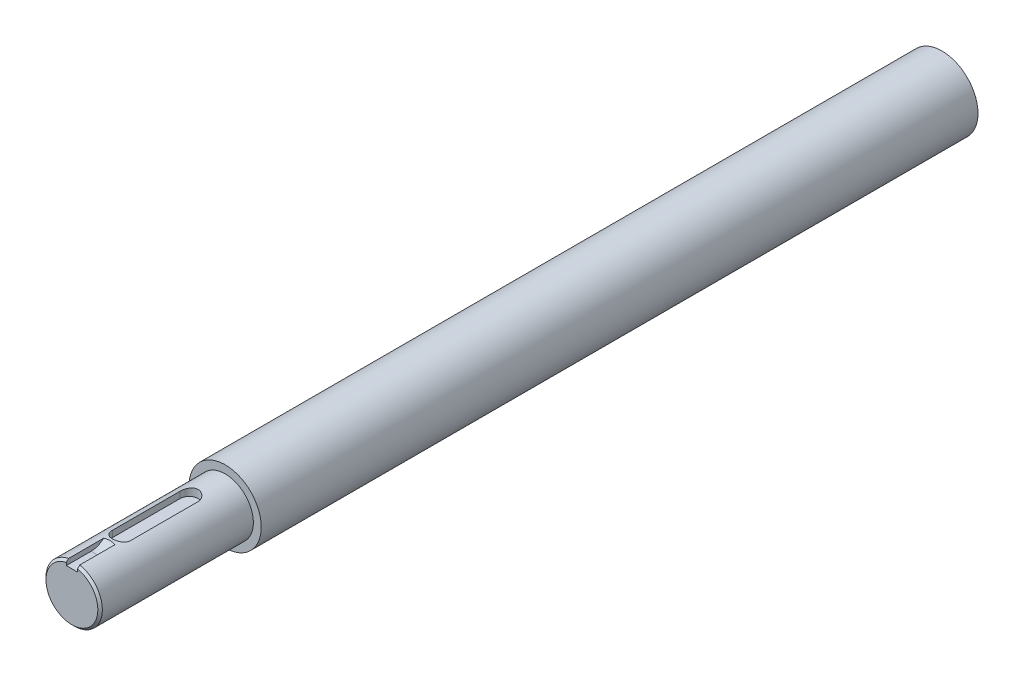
ISO-10303-21;
HEADER;
FILE_DESCRIPTION(('STEP AP214'),'2;1');
FILE_NAME('part.step','',(''),(''),'','','');
FILE_SCHEMA(('AUTOMOTIVE_DESIGN { 1 0 10303 214 1 1 1 1 }'));
ENDSEC;
DATA;
#1=APPLICATION_CONTEXT('core data for automotive mechanical design processes');
#2=APPLICATION_PROTOCOL_DEFINITION('international standard','automotive_design',2000,#1);
#3=PRODUCT_CONTEXT('',#1,'mechanical');
#4=PRODUCT('Part','Part','',(#3));
#5=PRODUCT_RELATED_PRODUCT_CATEGORY('part','',(#4));
#6=PRODUCT_DEFINITION_FORMATION('','',#4);
#7=PRODUCT_DEFINITION_CONTEXT('part definition',#1,'design');
#8=PRODUCT_DEFINITION('design','',#6,#7);
#9=PRODUCT_DEFINITION_SHAPE('','',#8);
#10=(LENGTH_UNIT() NAMED_UNIT(*) SI_UNIT(.MILLI.,.METRE.));
#11=(NAMED_UNIT(*) PLANE_ANGLE_UNIT() SI_UNIT($,.RADIAN.));
#12=(NAMED_UNIT(*) SI_UNIT($,.STERADIAN.) SOLID_ANGLE_UNIT());
#13=UNCERTAINTY_MEASURE_WITH_UNIT(LENGTH_MEASURE(1.E-05),#10,'distance_accuracy_value','');
#14=(GEOMETRIC_REPRESENTATION_CONTEXT(3) GLOBAL_UNCERTAINTY_ASSIGNED_CONTEXT((#13)) GLOBAL_UNIT_ASSIGNED_CONTEXT((#10,
#11,#12)) REPRESENTATION_CONTEXT('',''));
#15=CARTESIAN_POINT('',(0.,0.,0.));
#16=DIRECTION('',(0.,0.,1.));
#17=DIRECTION('',(1.,0.,0.));
#18=AXIS2_PLACEMENT_3D('',#15,#16,#17);
#19=CARTESIAN_POINT('',(0.,0.,68.));
#20=DIRECTION('',(0.,0.,-1.));
#21=DIRECTION('',(-1.,0.,0.));
#22=AXIS2_PLACEMENT_3D('',#19,#20,#21);
#23=CYLINDRICAL_SURFACE('',#22,12.5);
#24=DIRECTION('',(0.,0.,-1.));
#25=VECTOR('',#24,1.);
#26=CARTESIAN_POINT('',(4.,11.842719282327,68.));
#27=LINE('',#26,#25);
#28=CARTESIAN_POINT('',(4.,11.842719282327,16.));
#29=VERTEX_POINT('',#28);
#30=CARTESIAN_POINT('',(4.,11.842719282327,46.));
#31=VERTEX_POINT('',#30);
#32=EDGE_CURVE('E149',#29,#31,#27,.F.);
#33=ORIENTED_EDGE('',*,*,#32,.T.);
#34=CARTESIAN_POINT('',(4.,11.842719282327,46.));
#35=CARTESIAN_POINT('',(4.00001410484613,11.8427027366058,46.1093997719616));
#36=CARTESIAN_POINT('',(3.995512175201,11.8442348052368,46.2187902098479));
#37=CARTESIAN_POINT('',(3.97758606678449,11.8502730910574,46.4367282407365));
#38=CARTESIAN_POINT('',(3.96416412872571,11.8547785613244,46.5452760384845));
#39=CARTESIAN_POINT('',(3.92855725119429,11.8666242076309,46.7604610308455));
#40=CARTESIAN_POINT('',(3.9063967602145,11.8739564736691,46.8671026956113));
#41=CARTESIAN_POINT('',(3.85353581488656,11.8912164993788,47.0780056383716));
#42=CARTESIAN_POINT('',(3.82283508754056,11.90114434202,47.1822668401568));
#43=CARTESIAN_POINT('',(3.71831764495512,11.9343840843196,47.4903050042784));
#44=CARTESIAN_POINT('',(3.63203544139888,11.9611699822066,47.689636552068));
#45=CARTESIAN_POINT('',(3.42895021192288,12.0209583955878,48.0710125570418));
#46=CARTESIAN_POINT('',(3.3121303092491,12.0539643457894,48.2530473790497));
#47=CARTESIAN_POINT('',(3.04678507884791,12.123798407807,48.6012539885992));
#48=CARTESIAN_POINT('',(2.89735303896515,12.1607158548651,48.7667183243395));
#49=CARTESIAN_POINT('',(2.57296449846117,12.2334561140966,49.0707148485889));
#50=CARTESIAN_POINT('',(2.39800356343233,12.2692787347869,49.2092423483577));
#51=CARTESIAN_POINT('',(2.02237003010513,12.3368244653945,49.4586151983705));
#52=CARTESIAN_POINT('',(1.82118394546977,12.3684294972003,49.5687219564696));
#53=CARTESIAN_POINT('',(1.40197197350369,12.4229251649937,49.7532494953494));
#54=CARTESIAN_POINT('',(1.18395091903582,12.4458182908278,49.8276804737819));
#55=CARTESIAN_POINT('',(0.744713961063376,12.4796767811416,49.9363588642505));
#56=CARTESIAN_POINT('',(0.523827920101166,12.4910030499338,49.9718249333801));
#57=CARTESIAN_POINT('',(0.0789648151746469,12.5017287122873,50.0054327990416));
#58=CARTESIAN_POINT('',(-0.145011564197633,12.5011307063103,50.0035827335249));
#59=CARTESIAN_POINT('',(-0.581094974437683,12.4883236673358,49.9634011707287));
#60=CARTESIAN_POINT('',(-0.793338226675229,12.4765355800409,49.9263922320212));
#61=CARTESIAN_POINT('',(-1.2084232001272,12.443194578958,49.8191194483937));
#62=CARTESIAN_POINT('',(-1.41126440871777,12.4216411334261,49.7488537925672));
#63=CARTESIAN_POINT('',(-1.80478548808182,12.3706364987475,49.5762421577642));
#64=CARTESIAN_POINT('',(-1.99528012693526,12.3410893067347,49.4735034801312));
#65=CARTESIAN_POINT('',(-2.35673113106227,12.2771965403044,49.2391709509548));
#66=CARTESIAN_POINT('',(-2.52768253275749,12.2428497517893,49.107569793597));
#67=CARTESIAN_POINT('',(-2.8530451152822,12.1712409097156,48.8125534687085));
#68=CARTESIAN_POINT('',(-3.00641313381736,12.1339170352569,48.6480032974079));
#69=CARTESIAN_POINT('',(-3.28377291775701,12.0618172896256,48.2950280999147));
#70=CARTESIAN_POINT('',(-3.40775562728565,12.0270422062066,48.1065957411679));
#71=CARTESIAN_POINT('',(-3.56958208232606,11.9796198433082,47.8086287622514));
#72=CARTESIAN_POINT('',(-3.61975674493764,11.9645161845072,47.7060009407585));
#73=CARTESIAN_POINT('',(-3.71123075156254,11.9364591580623,47.4965952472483));
#74=CARTESIAN_POINT('',(-3.75253376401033,11.9235049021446,47.3898191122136));
#75=CARTESIAN_POINT('',(-3.82585831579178,11.9001802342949,47.1729866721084));
#76=CARTESIAN_POINT('',(-3.85788979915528,11.889807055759,47.0629340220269));
#77=CARTESIAN_POINT('',(-3.91241790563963,11.8719756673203,46.8403048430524));
#78=CARTESIAN_POINT('',(-3.93491889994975,11.8645161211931,46.7277294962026));
#79=CARTESIAN_POINT('',(-3.96832908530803,11.8533815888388,46.512760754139));
#80=CARTESIAN_POINT('',(-3.98020384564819,11.8493925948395,46.4105325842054));
#81=CARTESIAN_POINT('',(-3.9960393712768,11.8440568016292,46.2055389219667));
#82=CARTESIAN_POINT('',(-4.00001099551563,11.8427063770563,46.1027743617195));
#83=CARTESIAN_POINT('',(-4.,11.842719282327,46.));
#84=B_SPLINE_CURVE_WITH_KNOTS('',3,(#34,#35,#36,#37,#38,#39,#40,#41,#42,#43,#44,#45,#46,#47,#48,
#49,#50,#51,#52,#53,#54,#55,#56,#57,#58,#59,#60,#61,#62,#63,#64,#65,#66,#67,#68,#69,#70,#71,#72,
#73,#74,#75,#76,#77,#78,#79,#80,#81,#82,#83),.UNSPECIFIED.,.F.,.F.,(4,2,2,2,2,2,2,2,2,2,2,2,2,2,
2,2,2,2,2,2,2,2,2,2,4),(0.,0.328080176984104,0.656077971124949,0.983164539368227,
1.31026156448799,1.96355293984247,2.61720612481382,3.29209427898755,3.96709980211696,
4.65819584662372,5.34909422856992,6.01770820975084,6.68617638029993,7.33045501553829,
7.97476873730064,8.62719320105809,9.27978300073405,9.96076419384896,10.6419549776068,
10.9872862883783,11.3324745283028,11.6772911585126,12.0219494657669,12.3305938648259,
12.6388138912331),.UNSPECIFIED.);
#85=CARTESIAN_POINT('',(-4.,11.842719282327,46.));
#86=VERTEX_POINT('',#85);
#87=EDGE_CURVE('E153',#31,#86,#84,.T.);
#88=ORIENTED_EDGE('',*,*,#87,.T.);
#89=DIRECTION('',(0.,0.,-1.));
#90=VECTOR('',#89,1.);
#91=CARTESIAN_POINT('',(-4.,11.842719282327,68.));
#92=LINE('',#91,#90);
#93=CARTESIAN_POINT('',(-4.,11.842719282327,16.));
#94=VERTEX_POINT('',#93);
#95=EDGE_CURVE('E158',#86,#94,#92,.T.);
#96=ORIENTED_EDGE('',*,*,#95,.T.);
#97=CARTESIAN_POINT('',(-3.99999999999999,11.842719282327,16.));
#98=CARTESIAN_POINT('',(-4.00001410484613,11.8427027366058,15.8906002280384));
#99=CARTESIAN_POINT('',(-3.99551217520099,11.8442348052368,15.7812097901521));
#100=CARTESIAN_POINT('',(-3.97758606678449,11.8502730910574,15.5632717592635));
#101=CARTESIAN_POINT('',(-3.9641641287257,11.8547785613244,15.4547239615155));
#102=CARTESIAN_POINT('',(-3.92855725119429,11.8666242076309,15.2395389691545));
#103=CARTESIAN_POINT('',(-3.90639676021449,11.8739564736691,15.1328973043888));
#104=CARTESIAN_POINT('',(-3.85353581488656,11.8912164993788,14.9219943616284));
#105=CARTESIAN_POINT('',(-3.82283508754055,11.90114434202,14.8177331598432));
#106=CARTESIAN_POINT('',(-3.71831764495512,11.9343840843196,14.5096949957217));
#107=CARTESIAN_POINT('',(-3.63203544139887,11.9611699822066,14.310363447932));
#108=CARTESIAN_POINT('',(-3.42895021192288,12.0209583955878,13.9289874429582));
#109=CARTESIAN_POINT('',(-3.31213030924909,12.0539643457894,13.7469526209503));
#110=CARTESIAN_POINT('',(-3.0467850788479,12.123798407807,13.3987460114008));
#111=CARTESIAN_POINT('',(-2.89735303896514,12.1607158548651,13.2332816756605));
#112=CARTESIAN_POINT('',(-2.57296449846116,12.2334561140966,12.9292851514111));
#113=CARTESIAN_POINT('',(-2.39800356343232,12.2692787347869,12.7907576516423));
#114=CARTESIAN_POINT('',(-2.02237003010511,12.3368244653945,12.5413848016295));
#115=CARTESIAN_POINT('',(-1.82118394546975,12.3684294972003,12.4312780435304));
#116=CARTESIAN_POINT('',(-1.40197197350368,12.4229251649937,12.2467505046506));
#117=CARTESIAN_POINT('',(-1.1839509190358,12.4458182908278,12.1723195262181));
#118=CARTESIAN_POINT('',(-0.744713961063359,12.4796767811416,12.0636411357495));
#119=CARTESIAN_POINT('',(-0.52382792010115,12.4910030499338,12.0281750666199));
#120=CARTESIAN_POINT('',(-0.0789648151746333,12.5017287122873,11.9945672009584));
#121=CARTESIAN_POINT('',(0.145011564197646,12.5011307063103,11.9964172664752));
#122=CARTESIAN_POINT('',(0.581094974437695,12.4883236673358,12.0365988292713));
#123=CARTESIAN_POINT('',(0.793338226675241,12.4765355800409,12.0736077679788));
#124=CARTESIAN_POINT('',(1.20842320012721,12.443194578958,12.1808805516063));
#125=CARTESIAN_POINT('',(1.41126440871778,12.4216411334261,12.2511462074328));
#126=CARTESIAN_POINT('',(1.80478548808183,12.3706364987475,12.4237578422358));
#127=CARTESIAN_POINT('',(1.99528012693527,12.3410893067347,12.5264965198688));
#128=CARTESIAN_POINT('',(2.35673113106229,12.2771965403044,12.7608290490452));
#129=CARTESIAN_POINT('',(2.5276825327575,12.2428497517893,12.892430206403));
#130=CARTESIAN_POINT('',(2.85304511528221,12.1712409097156,13.1874465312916));
#131=CARTESIAN_POINT('',(3.00641313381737,12.1339170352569,13.3519967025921));
#132=CARTESIAN_POINT('',(3.28377291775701,12.0618172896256,13.7049719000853));
#133=CARTESIAN_POINT('',(3.40775562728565,12.0270422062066,13.8934042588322));
#134=CARTESIAN_POINT('',(3.56958208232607,11.9796198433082,14.1913712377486));
#135=CARTESIAN_POINT('',(3.61975674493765,11.9645161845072,14.2939990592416));
#136=CARTESIAN_POINT('',(3.71123075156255,11.9364591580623,14.5034047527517));
#137=CARTESIAN_POINT('',(3.75253376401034,11.9235049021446,14.6101808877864));
#138=CARTESIAN_POINT('',(3.82585831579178,11.9001802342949,14.8270133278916));
#139=CARTESIAN_POINT('',(3.85788979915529,11.889807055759,14.9370659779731));
#140=CARTESIAN_POINT('',(3.91241790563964,11.8719756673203,15.1596951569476));
#141=CARTESIAN_POINT('',(3.93491889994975,11.8645161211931,15.2722705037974));
#142=CARTESIAN_POINT('',(3.96832908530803,11.8533815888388,15.487239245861));
#143=CARTESIAN_POINT('',(3.9802038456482,11.8493925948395,15.5894674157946));
#144=CARTESIAN_POINT('',(3.9960393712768,11.8440568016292,15.7944610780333));
#145=CARTESIAN_POINT('',(4.00001099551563,11.8427063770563,15.8972256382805));
#146=CARTESIAN_POINT('',(4.,11.842719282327,16.));
#147=B_SPLINE_CURVE_WITH_KNOTS('',3,(#97,#98,#99,#100,#101,#102,#103,#104,#105,#106,#107,#108,
#109,#110,#111,#112,#113,#114,#115,#116,#117,#118,#119,#120,#121,#122,#123,#124,#125,#126,#127,
#128,#129,#130,#131,#132,#133,#134,#135,#136,#137,#138,#139,#140,#141,#142,#143,#144,#145,#146),
.UNSPECIFIED.,.F.,.F.,(4,2,2,2,2,2,2,2,2,2,2,2,2,2,2,2,2,2,2,2,2,2,2,2,4),(0.,0.328080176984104,
0.656077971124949,0.983164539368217,1.310261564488,1.96355293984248,2.61720612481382,
3.29209427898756,3.96709980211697,4.65819584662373,5.34909422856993,6.01770820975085,
6.68617638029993,7.3304550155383,7.97476873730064,8.6271932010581,9.27978300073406,
9.96076419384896,10.6419549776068,10.9872862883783,11.3324745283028,11.6772911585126,
12.0219494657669,12.3305938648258,12.6388138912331),.UNSPECIFIED.);
#148=EDGE_CURVE('E163',#94,#29,#147,.T.);
#149=ORIENTED_EDGE('',*,*,#148,.T.);
#150=EDGE_LOOP('',(#33,#88,#96,#149));
#151=FACE_BOUND('',#150,.T.);
#152=CARTESIAN_POINT('',(0.,0.,0.));
#153=DIRECTION('',(0.,0.,-1.));
#154=DIRECTION('',(-1.,0.,0.));
#155=AXIS2_PLACEMENT_3D('',#152,#153,#154);
#156=CIRCLE('',#155,12.5);
#157=CARTESIAN_POINT('',(-12.5,0.,0.));
#158=VERTEX_POINT('',#157);
#159=EDGE_CURVE('E146',#158,#158,#156,.T.);
#160=ORIENTED_EDGE('',*,*,#159,.F.);
#161=EDGE_LOOP('',(#160));
#162=FACE_BOUND('',#161,.T.);
#163=DIRECTION('',(0.,0.,-1.));
#164=VECTOR('',#163,1.);
#165=CARTESIAN_POINT('',(-2.5,12.2474487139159,68.));
#166=LINE('',#165,#164);
#167=CARTESIAN_POINT('',(-2.5,12.2474487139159,51.4404897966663));
#168=VERTEX_POINT('',#167);
#169=CARTESIAN_POINT('',(-2.5,12.2474487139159,67.));
#170=VERTEX_POINT('',#169);
#171=EDGE_CURVE('E137',#168,#170,#166,.F.);
#172=ORIENTED_EDGE('',*,*,#171,.F.);
#173=CARTESIAN_POINT('',(0.,12.5,62.8094750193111));
#174=CARTESIAN_POINT('',(-0.239595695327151,12.4999992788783,62.8094756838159));
#175=CARTESIAN_POINT('',(-0.479203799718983,12.4931020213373,62.8029680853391));
#176=CARTESIAN_POINT('',(-0.956929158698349,12.4656143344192,62.7767579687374));
#177=CARTESIAN_POINT('',(-1.19504627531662,12.4450226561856,62.7570542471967));
#178=CARTESIAN_POINT('',(-1.66843511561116,12.390445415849,62.7038892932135));
#179=CARTESIAN_POINT('',(-1.90370393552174,12.3564472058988,62.6704150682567));
#180=CARTESIAN_POINT('',(-2.36946620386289,12.2756460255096,62.5888342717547));
#181=CARTESIAN_POINT('',(-2.59995984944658,12.2288435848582,62.5407283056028));
#182=CARTESIAN_POINT('',(-3.05606355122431,12.1229407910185,62.4282768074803));
#183=CARTESIAN_POINT('',(-3.28162253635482,12.0637487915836,62.3638094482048));
#184=CARTESIAN_POINT('',(-3.72389744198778,11.9346405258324,62.2173691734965));
#185=CARTESIAN_POINT('',(-3.94061213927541,11.8647227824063,62.1353938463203));
#186=CARTESIAN_POINT('',(-4.36221995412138,11.7162648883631,61.9526254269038));
#187=CARTESIAN_POINT('',(-4.56714059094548,11.6377461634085,61.8518786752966));
#188=CARTESIAN_POINT('',(-4.96297691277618,11.4745202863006,61.63001586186));
#189=CARTESIAN_POINT('',(-5.15390065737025,11.3898167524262,61.5089116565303));
#190=CARTESIAN_POINT('',(-5.45748315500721,11.2465052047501,61.2896635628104));
#191=CARTESIAN_POINT('',(-5.57486990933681,11.188700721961,61.1974941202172));
#192=CARTESIAN_POINT('',(-5.80140819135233,11.0729321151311,61.0035587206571));
#193=CARTESIAN_POINT('',(-5.91055902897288,11.014967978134,60.9017919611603));
#194=CARTESIAN_POINT('',(-6.11970339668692,10.9001588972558,60.6887514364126));
#195=CARTESIAN_POINT('',(-6.21970088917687,10.8433134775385,60.5774818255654));
#196=CARTESIAN_POINT('',(-6.40977973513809,10.7320479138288,60.3456533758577));
#197=CARTESIAN_POINT('',(-6.49986233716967,10.6776274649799,60.2250957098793));
#198=CARTESIAN_POINT('',(-6.66996940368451,10.5722085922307,59.974312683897));
#199=CARTESIAN_POINT('',(-6.74992154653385,10.5212358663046,59.8440273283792));
#200=CARTESIAN_POINT('',(-6.89836991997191,10.4245069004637,59.5753212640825));
#201=CARTESIAN_POINT('',(-6.96687134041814,10.3787483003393,59.436904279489));
#202=CARTESIAN_POINT('',(-7.0919399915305,10.293692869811,59.1528604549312));
#203=CARTESIAN_POINT('',(-7.1485066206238,10.2543963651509,59.0072332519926));
#204=CARTESIAN_POINT('',(-7.24929354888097,10.1833958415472,58.7099819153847));
#205=CARTESIAN_POINT('',(-7.29351523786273,10.1516909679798,58.5583584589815));
#206=CARTESIAN_POINT('',(-7.36519404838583,10.0997847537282,58.2672868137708));
#207=CARTESIAN_POINT('',(-7.39395337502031,10.0787060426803,58.1283137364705));
#208=CARTESIAN_POINT('',(-7.44131474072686,10.0437893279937,57.8477547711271));
#209=CARTESIAN_POINT('',(-7.45991755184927,10.0299507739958,57.7061690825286));
#210=CARTESIAN_POINT('',(-7.48688103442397,10.0098399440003,57.4215364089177));
#211=CARTESIAN_POINT('',(-7.49524476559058,10.003565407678,57.2784898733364));
#212=CARTESIAN_POINT('',(-7.50170521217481,9.99872174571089,56.9920349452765));
#213=CARTESIAN_POINT('',(-7.49980214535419,10.0001524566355,56.8486265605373));
#214=CARTESIAN_POINT('',(-7.48611551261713,10.0104015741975,56.5702745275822));
#215=CARTESIAN_POINT('',(-7.47486721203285,10.0188197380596,56.4352893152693));
#216=CARTESIAN_POINT('',(-7.44322169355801,10.0423522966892,56.1669399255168));
#217=CARTESIAN_POINT('',(-7.42282150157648,10.0574688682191,56.033576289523));
#218=CARTESIAN_POINT('',(-7.37296632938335,10.0940735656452,55.7695184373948));
#219=CARTESIAN_POINT('',(-7.34351615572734,10.1155583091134,55.6388228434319));
#220=CARTESIAN_POINT('',(-7.27567395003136,10.1644634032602,55.3808612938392));
#221=CARTESIAN_POINT('',(-7.23727860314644,10.1918859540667,55.253596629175));
#222=CARTESIAN_POINT('',(-7.15148271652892,10.2522708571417,55.0026428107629));
#223=CARTESIAN_POINT('',(-7.10403240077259,10.2852637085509,54.8789779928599));
#224=CARTESIAN_POINT('',(-7.00051695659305,10.3559980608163,54.6366982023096));
#225=CARTESIAN_POINT('',(-6.94444873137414,10.3937412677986,54.5180850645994));
#226=CARTESIAN_POINT('',(-6.76376657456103,10.512956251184,54.1708893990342));
#227=CARTESIAN_POINT('',(-6.62660135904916,10.6004671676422,53.9507350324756));
#228=CARTESIAN_POINT('',(-6.31287192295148,10.7904219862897,53.5243823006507));
#229=CARTESIAN_POINT('',(-6.13441203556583,10.8934516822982,53.3198593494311));
#230=CARTESIAN_POINT('',(-5.74814222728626,11.1021138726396,52.9421941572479));
#231=CARTESIAN_POINT('',(-5.54031956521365,11.2077474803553,52.7690656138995));
#232=CARTESIAN_POINT('',(-5.19589885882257,11.3697734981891,52.5221059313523));
#233=CARTESIAN_POINT('',(-5.06738337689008,11.4276983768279,52.4377193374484));
#234=CARTESIAN_POINT('',(-4.80348056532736,11.5411075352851,52.2785324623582));
#235=CARTESIAN_POINT('',(-4.66809270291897,11.5965916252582,52.2037329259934));
#236=CARTESIAN_POINT('',(-4.3913006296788,11.7042107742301,52.0633137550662));
#237=CARTESIAN_POINT('',(-4.24989391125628,11.7563444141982,51.997697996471));
#238=CARTESIAN_POINT('',(-3.96192346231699,11.8564922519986,51.8752005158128));
#239=CARTESIAN_POINT('',(-3.81535906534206,11.9045059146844,51.8183199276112));
#240=CARTESIAN_POINT('',(-3.4882809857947,12.0048602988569,51.7023303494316));
#241=CARTESIAN_POINT('',(-3.30680828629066,12.0561650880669,51.6450243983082));
#242=CARTESIAN_POINT('',(-2.93877834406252,12.1511199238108,51.5414713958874));
#243=CARTESIAN_POINT('',(-2.75222055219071,12.1947691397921,51.4952255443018));
#244=CARTESIAN_POINT('',(-2.37503220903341,12.2738082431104,51.4130526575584));
#245=CARTESIAN_POINT('',(-2.18439968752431,12.3091940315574,51.3771307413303));
#246=CARTESIAN_POINT('',(-1.80014820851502,12.3712309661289,51.3150303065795));
#247=CARTESIAN_POINT('',(-1.6065290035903,12.3978813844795,51.2888525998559));
#248=CARTESIAN_POINT('',(-1.18017934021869,12.4463461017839,51.2416757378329));
#249=CARTESIAN_POINT('',(-0.947016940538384,12.4662753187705,51.2226097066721));
#250=CARTESIAN_POINT('',(-0.479240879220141,12.4930072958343,51.1971243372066));
#251=CARTESIAN_POINT('',(-0.244627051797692,12.4998085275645,51.1907064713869));
#252=CARTESIAN_POINT('',(0.224876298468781,12.5001836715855,51.190350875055));
#253=CARTESIAN_POINT('',(0.459765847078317,12.493743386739,51.196426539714));
#254=CARTESIAN_POINT('',(0.928143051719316,12.4677010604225,51.2212467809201));
#255=CARTESIAN_POINT('',(1.16163069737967,12.4480989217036,51.2399914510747));
#256=CARTESIAN_POINT('',(1.64493715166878,12.3938725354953,51.2927329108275));
#257=CARTESIAN_POINT('',(1.89451061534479,12.3581405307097,51.3278623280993));
#258=CARTESIAN_POINT('',(2.38832937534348,12.2722732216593,51.4145842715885));
#259=CARTESIAN_POINT('',(2.63257375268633,12.222135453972,51.4661796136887));
#260=CARTESIAN_POINT('',(3.11308596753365,12.1086556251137,51.58715134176));
#261=CARTESIAN_POINT('',(3.3493654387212,12.0453338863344,51.6565003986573));
#262=CARTESIAN_POINT('',(3.8117546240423,11.9070847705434,51.8146922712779));
#263=CARTESIAN_POINT('',(4.03786886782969,11.8321626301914,51.9035262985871));
#264=CARTESIAN_POINT('',(4.4118312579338,11.6966989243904,52.0728933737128));
#265=CARTESIAN_POINT('',(4.56297849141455,11.6384954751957,52.148055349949));
#266=CARTESIAN_POINT('',(4.85776364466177,11.5185686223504,52.3094608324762));
#267=CARTESIAN_POINT('',(5.00140326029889,11.4568460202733,52.3957018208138));
#268=CARTESIAN_POINT('',(5.27997909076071,11.3311590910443,52.5797100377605));
#269=CARTESIAN_POINT('',(5.41491917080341,11.2671957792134,52.6774720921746));
#270=CARTESIAN_POINT('',(5.67498346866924,11.1384744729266,52.8848624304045));
#271=CARTESIAN_POINT('',(5.8001074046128,11.0737164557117,52.9944910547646));
#272=CARTESIAN_POINT('',(6.04047525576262,10.9444715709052,53.2267599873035));
#273=CARTESIAN_POINT('',(6.15561486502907,10.8799930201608,53.3495132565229));
#274=CARTESIAN_POINT('',(6.37349059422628,10.7538119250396,53.6068768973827));
#275=CARTESIAN_POINT('',(6.47622871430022,10.6921089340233,53.741485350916));
#276=CARTESIAN_POINT('',(6.66821567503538,10.573440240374,54.021852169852));
#277=CARTESIAN_POINT('',(6.75747141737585,10.5164721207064,54.1676047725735));
#278=CARTESIAN_POINT('',(6.9216462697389,10.4091518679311,54.4692629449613));
#279=CARTESIAN_POINT('',(6.9965682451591,10.3587984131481,54.6251664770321));
#280=CARTESIAN_POINT('',(7.12117910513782,10.2734424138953,54.9214518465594));
#281=CARTESIAN_POINT('',(7.17297034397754,10.2372699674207,55.0606171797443));
#282=CARTESIAN_POINT('',(7.26539878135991,10.1718823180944,55.3441821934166));
#283=CARTESIAN_POINT('',(7.30603747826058,10.1426661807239,55.4885811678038));
#284=CARTESIAN_POINT('',(7.37591560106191,10.0919638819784,55.7813802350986));
#285=CARTESIAN_POINT('',(7.40515929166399,10.0704748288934,55.9297788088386));
#286=CARTESIAN_POINT('',(7.45211354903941,10.0357790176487,56.2293428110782));
#287=CARTESIAN_POINT('',(7.46982480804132,10.0225717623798,56.3805080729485));
#288=CARTESIAN_POINT('',(7.49247646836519,10.0056469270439,56.6695358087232));
#289=CARTESIAN_POINT('',(7.49848714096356,10.0011344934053,56.8072695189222));
#290=CARTESIAN_POINT('',(7.50100995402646,9.99924267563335,57.082870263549));
#291=CARTESIAN_POINT('',(7.49752257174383,10.0018629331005,57.22073729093));
#292=CARTESIAN_POINT('',(7.48106536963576,10.0141782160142,57.4955443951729));
#293=CARTESIAN_POINT('',(7.46809828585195,10.0238712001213,57.6324847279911));
#294=CARTESIAN_POINT('',(7.43273610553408,10.0501202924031,57.9044775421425));
#295=CARTESIAN_POINT('',(7.41034093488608,10.0666764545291,58.0395300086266));
#296=CARTESIAN_POINT('',(7.35672376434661,10.1059237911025,58.3042752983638));
#297=CARTESIAN_POINT('',(7.32567470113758,10.1284944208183,58.4340211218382));
#298=CARTESIAN_POINT('',(7.2547128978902,10.1794423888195,58.6899431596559));
#299=CARTESIAN_POINT('',(7.21479722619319,10.2078216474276,58.8161181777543));
#300=CARTESIAN_POINT('',(7.12631286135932,10.2697895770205,59.0640167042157));
#301=CARTESIAN_POINT('',(7.07774746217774,10.3033762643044,59.1857418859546));
#302=CARTESIAN_POINT('',(6.97218257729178,10.3751020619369,59.4241359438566));
#303=CARTESIAN_POINT('',(6.91517994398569,10.4132428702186,59.5408029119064));
#304=CARTESIAN_POINT('',(6.79098360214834,10.4946763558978,59.7723048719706));
#305=CARTESIAN_POINT('',(6.72351004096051,10.5380998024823,59.8869438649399));
#306=CARTESIAN_POINT('',(6.58028965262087,10.6281212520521,60.1096386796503));
#307=CARTESIAN_POINT('',(6.50453982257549,10.6747204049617,60.2176920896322));
#308=CARTESIAN_POINT('',(6.26557357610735,10.8178988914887,60.5313075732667));
#309=CARTESIAN_POINT('',(6.09055645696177,10.9179159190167,60.7264804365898));
#310=CARTESIAN_POINT('',(5.69493403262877,11.1298198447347,61.1051717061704));
#311=CARTESIAN_POINT('',(5.47153025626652,11.2419011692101,61.2856207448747));
#312=CARTESIAN_POINT('',(4.99811680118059,11.4602240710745,61.6119366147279));
#313=CARTESIAN_POINT('',(4.74809195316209,11.5664622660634,61.757783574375));
#314=CARTESIAN_POINT('',(4.33508804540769,11.7253568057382,61.9636754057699));
#315=CARTESIAN_POINT('',(4.17875807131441,11.7820350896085,62.0342933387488));
#316=CARTESIAN_POINT('',(3.86003800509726,11.8902642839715,62.1651084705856));
#317=CARTESIAN_POINT('',(3.69764730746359,11.9418146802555,62.225304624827));
#318=CARTESIAN_POINT('',(3.36777633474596,12.0390065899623,62.3359141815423));
#319=CARTESIAN_POINT('',(3.20029375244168,12.0846453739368,62.3863230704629));
#320=CARTESIAN_POINT('',(2.8612051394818,12.1693899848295,62.4779447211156));
#321=CARTESIAN_POINT('',(2.68959869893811,12.2084951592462,62.5191565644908));
#322=CARTESIAN_POINT('',(2.31258744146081,12.2859756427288,62.5994262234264));
#323=CARTESIAN_POINT('',(2.10655231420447,12.3230097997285,62.6368267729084));
#324=CARTESIAN_POINT('',(1.69118946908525,12.3868497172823,62.7004007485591));
#325=CARTESIAN_POINT('',(1.48186144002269,12.413654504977,62.7265731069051));
#326=CARTESIAN_POINT('',(1.06097388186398,12.4566890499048,62.7682408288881));
#327=CARTESIAN_POINT('',(0.849413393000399,12.4729140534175,62.7837313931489));
#328=CARTESIAN_POINT('',(0.425238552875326,12.4945700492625,62.8043483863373));
#329=CARTESIAN_POINT('',(0.212624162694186,12.5000006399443,62.8094744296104));
#330=CARTESIAN_POINT('',(0.,12.5,62.8094750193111));
#331=B_SPLINE_CURVE_WITH_KNOTS('',3,(#173,#174,#175,#176,#177,#178,#179,#180,#181,#182,#183,
#184,#185,#186,#187,#188,#189,#190,#191,#192,#193,#194,#195,#196,#197,#198,#199,#200,#201,#202,
#203,#204,#205,#206,#207,#208,#209,#210,#211,#212,#213,#214,#215,#216,#217,#218,#219,#220,#221,
#222,#223,#224,#225,#226,#227,#228,#229,#230,#231,#232,#233,#234,#235,#236,#237,#238,#239,#240,
#241,#242,#243,#244,#245,#246,#247,#248,#249,#250,#251,#252,#253,#254,#255,#256,#257,#258,#259,
#260,#261,#262,#263,#264,#265,#266,#267,#268,#269,#270,#271,#272,#273,#274,#275,#276,#277,#278,
#279,#280,#281,#282,#283,#284,#285,#286,#287,#288,#289,#290,#291,#292,#293,#294,#295,#296,#297,
#298,#299,#300,#301,#302,#303,#304,#305,#306,#307,#308,#309,#310,#311,#312,#313,#314,#315,#316,
#317,#318,#319,#320,#321,#322,#323,#324,#325,#326,#327,#328,#329,#330),.UNSPECIFIED.,.T.,.F.,(4,
2,2,2,2,2,2,2,2,2,2,2,2,2,2,2,2,2,2,2,2,2,2,2,2,2,2,2,2,2,2,2,2,2,2,2,2,2,2,2,2,2,2,2,2,2,2,2,2,
2,2,2,2,2,2,2,2,2,2,2,2,2,2,2,2,2,2,2,2,2,2,2,2,2,2,2,2,2,4),(0.,0.718619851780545,
1.43730524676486,2.15667028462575,2.87600556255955,3.60086277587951,4.32581990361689,
5.04901050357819,5.77178135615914,6.25149185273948,6.73124249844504,7.21078447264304,
7.6902659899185,8.17299781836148,8.65551025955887,9.13804701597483,9.62052942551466,
10.0504032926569,10.4802444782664,10.9099571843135,11.339660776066,11.7463235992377,
12.1531186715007,12.5596980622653,12.9664283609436,13.3754624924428,13.7846439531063,
14.6023125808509,15.4699571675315,16.3379794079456,16.8304806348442,17.3230201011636,
17.815766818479,18.3085774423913,18.899311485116,19.4901095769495,20.0812001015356,
20.6723398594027,21.3759596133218,22.0796612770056,22.7841178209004,23.4885795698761,
24.2512700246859,25.0140909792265,25.7757446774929,26.5370555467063,27.072248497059,
27.6073200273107,28.1421521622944,28.6769996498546,29.2168912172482,29.7566955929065,
30.2962226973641,30.8356418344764,31.2935143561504,31.7513253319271,32.2089648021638,
32.666576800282,33.0798914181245,33.4931852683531,33.9063598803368,34.3195377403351,
34.7249873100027,35.1305711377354,35.5360008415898,35.9415821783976,36.3609052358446,
36.780380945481,37.6187815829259,38.5402286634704,39.4622036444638,40.0037697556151,
40.5453901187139,41.087259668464,41.6291833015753,42.2665368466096,42.9039509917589,
43.5416513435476,44.1793754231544),.UNSPECIFIED.);
#332=CARTESIAN_POINT('',(2.5,12.2474487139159,51.4404897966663));
#333=VERTEX_POINT('',#332);
#334=EDGE_CURVE('E11',#168,#333,#331,.T.);
#335=ORIENTED_EDGE('',*,*,#334,.T.);
#336=DIRECTION('',(0.,0.,-1.));
#337=VECTOR('',#336,1.);
#338=CARTESIAN_POINT('',(2.5,12.2474487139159,68.));
#339=LINE('',#338,#337);
#340=CARTESIAN_POINT('',(2.5,12.2474487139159,67.));
#341=VERTEX_POINT('',#340);
#342=EDGE_CURVE('E127',#333,#341,#339,.F.);
#343=ORIENTED_EDGE('',*,*,#342,.T.);
#344=CARTESIAN_POINT('',(0.,0.,67.));
#345=DIRECTION('',(0.,0.,1.));
#346=DIRECTION('',(1.,0.,0.));
#347=AXIS2_PLACEMENT_3D('',#344,#345,#346);
#348=CIRCLE('',#347,12.5);
#349=EDGE_CURVE('E221',#341,#170,#348,.F.);
#350=ORIENTED_EDGE('',*,*,#349,.T.);
#351=EDGE_LOOP('',(#172,#335,#343,#350));
#352=FACE_BOUND('',#351,.T.);
#353=ADVANCED_FACE('F34',(#151,#162,#352),#23,.T.);
#354=CARTESIAN_POINT('',(0.,0.,68.));
#355=DIRECTION('',(0.,0.,1.));
#356=DIRECTION('',(1.,0.,0.));
#357=AXIS2_PLACEMENT_3D('',#354,#355,#356);
#358=PLANE('',#357);
#359=DIRECTION('',(1.,0.,0.));
#360=VECTOR('',#359,1.);
#361=CARTESIAN_POINT('',(0.,10.,68.));
#362=LINE('',#361,#360);
#363=CARTESIAN_POINT('',(-2.5,10.,68.));
#364=VERTEX_POINT('',#363);
#365=CARTESIAN_POINT('',(2.5,10.,68.));
#366=VERTEX_POINT('',#365);
#367=EDGE_CURVE('E45',#364,#366,#362,.T.);
#368=ORIENTED_EDGE('',*,*,#367,.F.);
#369=DIRECTION('',(0.,1.,0.));
#370=VECTOR('',#369,1.);
#371=CARTESIAN_POINT('',(-2.5,0.,68.));
#372=LINE('',#371,#370);
#373=CARTESIAN_POINT('',(-2.5,11.2249721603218,68.));
#374=VERTEX_POINT('',#373);
#375=EDGE_CURVE('E134',#364,#374,#372,.T.);
#376=ORIENTED_EDGE('',*,*,#375,.T.);
#377=CARTESIAN_POINT('',(0.,0.,68.));
#378=DIRECTION('',(0.,0.,1.));
#379=DIRECTION('',(1.,0.,0.));
#380=AXIS2_PLACEMENT_3D('',#377,#378,#379);
#381=CIRCLE('',#380,11.5);
#382=CARTESIAN_POINT('',(2.5,11.2249721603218,68.));
#383=VERTEX_POINT('',#382);
#384=EDGE_CURVE('E168',#374,#383,#381,.T.);
#385=ORIENTED_EDGE('',*,*,#384,.T.);
#386=DIRECTION('',(0.,1.,0.));
#387=VECTOR('',#386,1.);
#388=CARTESIAN_POINT('',(2.5,0.,68.));
#389=LINE('',#388,#387);
#390=EDGE_CURVE('E52',#366,#383,#389,.T.);
#391=ORIENTED_EDGE('',*,*,#390,.F.);
#392=EDGE_LOOP('',(#368,#376,#385,#391));
#393=FACE_BOUND('',#392,.T.);
#394=ADVANCED_FACE('F209',(#393),#358,.T.);
#395=CARTESIAN_POINT('',(0.,0.,68.));
#396=DIRECTION('',(0.,0.,-1.));
#397=DIRECTION('',(-1.,0.,0.));
#398=AXIS2_PLACEMENT_3D('',#395,#396,#397);
#399=CONICAL_SURFACE('',#398,11.5,0.785398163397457);
#400=ORIENTED_EDGE('',*,*,#384,.F.);
#401=CARTESIAN_POINT('',(-2.5,7.4354720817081,71.6554958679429));
#402=CARTESIAN_POINT('',(-2.5,7.59902856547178,71.5004620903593));
#403=CARTESIAN_POINT('',(-2.5,7.76233120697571,71.3451610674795));
#404=CARTESIAN_POINT('',(-2.5,8.08850068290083,71.0341027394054));
#405=CARTESIAN_POINT('',(-2.5,8.25136751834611,70.8783454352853));
#406=CARTESIAN_POINT('',(-2.5,8.73942050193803,70.4105079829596));
#407=CARTESIAN_POINT('',(-2.5,9.06406192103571,70.0978596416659));
#408=CARTESIAN_POINT('',(-2.5,9.71227636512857,69.4714718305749));
#409=CARTESIAN_POINT('',(-2.5,10.0358494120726,69.157732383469));
#410=CARTESIAN_POINT('',(-2.5,10.6821919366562,68.52942554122));
#411=CARTESIAN_POINT('',(-2.5,11.0049614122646,68.2148581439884));
#412=CARTESIAN_POINT('',(-2.5,11.9723368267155,67.2702266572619));
#413=CARTESIAN_POINT('',(-2.5,12.616022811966,66.639220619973));
#414=CARTESIAN_POINT('',(-2.5,13.5804013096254,65.6915295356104));
#415=CARTESIAN_POINT('',(-2.5,13.9016723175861,65.3754322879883));
#416=CARTESIAN_POINT('',(-2.5,14.5438920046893,64.7429103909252));
#417=CARTESIAN_POINT('',(-2.5,14.864840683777,64.4264857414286));
#418=CARTESIAN_POINT('',(-2.5,15.1856598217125,64.1099296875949));
#419=B_SPLINE_CURVE_WITH_KNOTS('',3,(#401,#402,#403,#404,#405,#406,#407,#408,#409,#410,#411,
#412,#413,#414,#415,#416,#417,#418),.UNSPECIFIED.,.F.,.F.,(4,2,2,2,2,2,2,2,4),(0.,
0.676072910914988,1.35214423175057,2.7042753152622,4.05637844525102,5.40848498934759,
8.11264352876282,9.4647502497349,10.8168572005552),.UNSPECIFIED.);
#420=EDGE_CURVE('E225',#374,#170,#419,.T.);
#421=ORIENTED_EDGE('',*,*,#420,.T.);
#422=ORIENTED_EDGE('',*,*,#349,.F.);
#423=CARTESIAN_POINT('',(2.5,7.4354720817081,71.6554958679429));
#424=CARTESIAN_POINT('',(2.5,7.59902856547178,71.5004620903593));
#425=CARTESIAN_POINT('',(2.5,7.76233120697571,71.3451610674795));
#426=CARTESIAN_POINT('',(2.5,8.08850068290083,71.0341027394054));
#427=CARTESIAN_POINT('',(2.5,8.25136751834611,70.8783454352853));
#428=CARTESIAN_POINT('',(2.5,8.73942050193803,70.4105079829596));
#429=CARTESIAN_POINT('',(2.5,9.06406192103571,70.0978596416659));
#430=CARTESIAN_POINT('',(2.5,9.71227636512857,69.4714718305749));
#431=CARTESIAN_POINT('',(2.5,10.0358494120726,69.157732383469));
#432=CARTESIAN_POINT('',(2.5,10.6821919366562,68.52942554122));
#433=CARTESIAN_POINT('',(2.5,11.0049614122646,68.2148581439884));
#434=CARTESIAN_POINT('',(2.5,11.9723368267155,67.2702266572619));
#435=CARTESIAN_POINT('',(2.5,12.616022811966,66.639220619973));
#436=CARTESIAN_POINT('',(2.5,13.5804013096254,65.6915295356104));
#437=CARTESIAN_POINT('',(2.5,13.9016723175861,65.3754322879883));
#438=CARTESIAN_POINT('',(2.5,14.5438920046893,64.7429103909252));
#439=CARTESIAN_POINT('',(2.5,14.864840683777,64.4264857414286));
#440=CARTESIAN_POINT('',(2.5,15.1856598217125,64.1099296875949));
#441=B_SPLINE_CURVE_WITH_KNOTS('',3,(#423,#424,#425,#426,#427,#428,#429,#430,#431,#432,#433,
#434,#435,#436,#437,#438,#439,#440),.UNSPECIFIED.,.F.,.F.,(4,2,2,2,2,2,2,2,4),(0.,
0.676072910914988,1.35214423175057,2.7042753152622,4.05637844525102,5.40848498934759,
8.11264352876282,9.4647502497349,10.8168572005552),.UNSPECIFIED.);
#442=EDGE_CURVE('E229',#383,#341,#441,.T.);
#443=ORIENTED_EDGE('',*,*,#442,.F.);
#444=EDGE_LOOP('',(#400,#421,#422,#443));
#445=FACE_BOUND('',#444,.T.);
#446=ADVANCED_FACE('F188',(#445),#399,.T.);
#447=CARTESIAN_POINT('',(0.,9.,16.));
#448=DIRECTION('',(0.,1.,0.));
#449=DIRECTION('',(-1.,0.,0.));
#450=AXIS2_PLACEMENT_3D('',#447,#448,#449);
#451=PLANE('',#450);
#452=CARTESIAN_POINT('',(0.,9.,16.));
#453=DIRECTION('',(0.,1.,0.));
#454=DIRECTION('',(-1.,0.,0.));
#455=AXIS2_PLACEMENT_3D('',#452,#453,#454);
#456=CIRCLE('',#455,4.);
#457=CARTESIAN_POINT('',(4.,9.,16.));
#458=VERTEX_POINT('',#457);
#459=CARTESIAN_POINT('',(-4.,9.,16.));
#460=VERTEX_POINT('',#459);
#461=EDGE_CURVE('E165',#458,#460,#456,.T.);
#462=ORIENTED_EDGE('',*,*,#461,.T.);
#463=DIRECTION('',(0.,0.,1.));
#464=VECTOR('',#463,1.);
#465=CARTESIAN_POINT('',(-4.,9.,16.));
#466=LINE('',#465,#464);
#467=CARTESIAN_POINT('',(-4.,9.,46.));
#468=VERTEX_POINT('',#467);
#469=EDGE_CURVE('E160',#460,#468,#466,.T.);
#470=ORIENTED_EDGE('',*,*,#469,.T.);
#471=CARTESIAN_POINT('',(0.,9.,46.));
#472=DIRECTION('',(0.,1.,0.));
#473=DIRECTION('',(-1.,0.,0.));
#474=AXIS2_PLACEMENT_3D('',#471,#472,#473);
#475=CIRCLE('',#474,4.);
#476=CARTESIAN_POINT('',(4.,9.,46.));
#477=VERTEX_POINT('',#476);
#478=EDGE_CURVE('E155',#468,#477,#475,.T.);
#479=ORIENTED_EDGE('',*,*,#478,.T.);
#480=DIRECTION('',(0.,0.,-1.));
#481=VECTOR('',#480,1.);
#482=CARTESIAN_POINT('',(4.,9.,46.));
#483=LINE('',#482,#481);
#484=EDGE_CURVE('E150',#477,#458,#483,.T.);
#485=ORIENTED_EDGE('',*,*,#484,.T.);
#486=EDGE_LOOP('',(#462,#470,#479,#485));
#487=FACE_BOUND('',#486,.T.);
#488=ADVANCED_FACE('F259',(#487),#451,.T.);
#489=CARTESIAN_POINT('',(4.,12.501,46.));
#490=DIRECTION('',(-1.,0.,0.));
#491=DIRECTION('',(0.,-1.,0.));
#492=AXIS2_PLACEMENT_3D('',#489,#490,#491);
#493=PLANE('',#492);
#494=DIRECTION('',(0.,-1.,0.));
#495=VECTOR('',#494,1.);
#496=CARTESIAN_POINT('',(4.,12.501,16.));
#497=LINE('',#496,#495);
#498=EDGE_CURVE('E60',#29,#458,#497,.T.);
#499=ORIENTED_EDGE('',*,*,#498,.T.);
#500=ORIENTED_EDGE('',*,*,#484,.F.);
#501=DIRECTION('',(0.,-1.,0.));
#502=VECTOR('',#501,1.);
#503=CARTESIAN_POINT('',(4.,12.501,46.));
#504=LINE('',#503,#502);
#505=EDGE_CURVE('E154',#31,#477,#504,.T.);
#506=ORIENTED_EDGE('',*,*,#505,.F.);
#507=ORIENTED_EDGE('',*,*,#32,.F.);
#508=EDGE_LOOP('',(#499,#500,#506,#507));
#509=FACE_BOUND('',#508,.T.);
#510=ADVANCED_FACE('F186',(#509),#493,.T.);
#511=CARTESIAN_POINT('',(0.,12.501,46.));
#512=DIRECTION('',(0.,-1.,0.));
#513=DIRECTION('',(1.,0.,0.));
#514=AXIS2_PLACEMENT_3D('',#511,#512,#513);
#515=CYLINDRICAL_SURFACE('',#514,4.);
#516=ORIENTED_EDGE('',*,*,#505,.T.);
#517=ORIENTED_EDGE('',*,*,#478,.F.);
#518=DIRECTION('',(0.,-1.,0.));
#519=VECTOR('',#518,1.);
#520=CARTESIAN_POINT('',(-4.,12.501,46.));
#521=LINE('',#520,#519);
#522=EDGE_CURVE('E159',#86,#468,#521,.T.);
#523=ORIENTED_EDGE('',*,*,#522,.F.);
#524=ORIENTED_EDGE('',*,*,#87,.F.);
#525=EDGE_LOOP('',(#516,#517,#523,#524));
#526=FACE_BOUND('',#525,.T.);
#527=ADVANCED_FACE('F197',(#526),#515,.F.);
#528=CARTESIAN_POINT('',(-4.,12.501,16.));
#529=DIRECTION('',(1.,0.,0.));
#530=DIRECTION('',(0.,1.,0.));
#531=AXIS2_PLACEMENT_3D('',#528,#529,#530);
#532=PLANE('',#531);
#533=ORIENTED_EDGE('',*,*,#522,.T.);
#534=ORIENTED_EDGE('',*,*,#469,.F.);
#535=DIRECTION('',(0.,-1.,0.));
#536=VECTOR('',#535,1.);
#537=CARTESIAN_POINT('',(-4.,12.501,16.));
#538=LINE('',#537,#536);
#539=EDGE_CURVE('E164',#94,#460,#538,.T.);
#540=ORIENTED_EDGE('',*,*,#539,.F.);
#541=ORIENTED_EDGE('',*,*,#95,.F.);
#542=EDGE_LOOP('',(#533,#534,#540,#541));
#543=FACE_BOUND('',#542,.T.);
#544=ADVANCED_FACE('F200',(#543),#532,.T.);
#545=CARTESIAN_POINT('',(0.,12.501,16.));
#546=DIRECTION('',(0.,-1.,0.));
#547=DIRECTION('',(1.,0.,0.));
#548=AXIS2_PLACEMENT_3D('',#545,#546,#547);
#549=CYLINDRICAL_SURFACE('',#548,4.);
#550=ORIENTED_EDGE('',*,*,#539,.T.);
#551=ORIENTED_EDGE('',*,*,#461,.F.);
#552=ORIENTED_EDGE('',*,*,#498,.F.);
#553=ORIENTED_EDGE('',*,*,#148,.F.);
#554=EDGE_LOOP('',(#550,#551,#552,#553));
#555=FACE_BOUND('',#554,.T.);
#556=ADVANCED_FACE('F179',(#555),#549,.F.);
#557=CARTESIAN_POINT('',(0.,0.,0.));
#558=DIRECTION('',(0.,0.,-1.));
#559=DIRECTION('',(-1.,0.,0.));
#560=AXIS2_PLACEMENT_3D('',#557,#558,#559);
#561=PLANE('',#560);
#562=CARTESIAN_POINT('',(0.,0.,0.));
#563=DIRECTION('',(0.,0.,-1.));
#564=DIRECTION('',(-1.,0.,0.));
#565=AXIS2_PLACEMENT_3D('',#562,#563,#564);
#566=CIRCLE('',#565,16.);
#567=CARTESIAN_POINT('',(16.,0.,0.));
#568=VERTEX_POINT('',#567);
#569=EDGE_CURVE('E139',#568,#568,#566,.T.);
#570=ORIENTED_EDGE('',*,*,#569,.F.);
#571=EDGE_LOOP('',(#570));
#572=FACE_BOUND('',#571,.T.);
#573=ORIENTED_EDGE('',*,*,#159,.T.);
#574=EDGE_LOOP('',(#573));
#575=FACE_BOUND('',#574,.T.);
#576=ADVANCED_FACE('F207',(#572,#575),#561,.F.);
#577=CARTESIAN_POINT('',(0.,0.,-318.));
#578=DIRECTION('',(0.,0.,1.));
#579=DIRECTION('',(1.,0.,0.));
#580=AXIS2_PLACEMENT_3D('',#577,#578,#579);
#581=CYLINDRICAL_SURFACE('',#580,16.);
#582=CARTESIAN_POINT('',(0.,0.,-318.));
#583=DIRECTION('',(0.,0.,-1.));
#584=DIRECTION('',(-1.,0.,0.));
#585=AXIS2_PLACEMENT_3D('',#582,#583,#584);
#586=CIRCLE('',#585,16.);
#587=CARTESIAN_POINT('',(16.,0.,-318.));
#588=VERTEX_POINT('',#587);
#589=EDGE_CURVE('E142',#588,#588,#586,.T.);
#590=CARTESIAN_POINT('',(16.,0.,-318.));
#591=CARTESIAN_POINT('',(16.,0.,-314.6875));
#592=CARTESIAN_POINT('',(16.,0.,-311.375));
#593=CARTESIAN_POINT('',(16.,0.,-304.75));
#594=CARTESIAN_POINT('',(16.,0.,-301.4375));
#595=CARTESIAN_POINT('',(16.,0.,-294.8125));
#596=CARTESIAN_POINT('',(16.,0.,-291.5));
#597=CARTESIAN_POINT('',(16.,0.,-284.875));
#598=CARTESIAN_POINT('',(16.,0.,-281.5625));
#599=CARTESIAN_POINT('',(16.,0.,-274.9375));
#600=CARTESIAN_POINT('',(16.,0.,-271.625));
#601=CARTESIAN_POINT('',(16.,0.,-265.));
#602=CARTESIAN_POINT('',(16.,0.,-261.6875));
#603=CARTESIAN_POINT('',(16.,0.,-255.0625));
#604=CARTESIAN_POINT('',(16.,0.,-251.75));
#605=CARTESIAN_POINT('',(16.,0.,-245.125));
#606=CARTESIAN_POINT('',(16.,0.,-241.8125));
#607=CARTESIAN_POINT('',(16.,0.,-235.1875));
#608=CARTESIAN_POINT('',(16.,0.,-231.875));
#609=CARTESIAN_POINT('',(16.,0.,-225.25));
#610=CARTESIAN_POINT('',(16.,0.,-221.9375));
#611=CARTESIAN_POINT('',(16.,0.,-215.3125));
#612=CARTESIAN_POINT('',(16.,0.,-212.));
#613=CARTESIAN_POINT('',(16.,0.,-205.375));
#614=CARTESIAN_POINT('',(16.,0.,-202.0625));
#615=CARTESIAN_POINT('',(16.,0.,-195.4375));
#616=CARTESIAN_POINT('',(16.,0.,-192.125));
#617=CARTESIAN_POINT('',(16.,0.,-185.5));
#618=CARTESIAN_POINT('',(16.,0.,-182.1875));
#619=CARTESIAN_POINT('',(16.,0.,-175.5625));
#620=CARTESIAN_POINT('',(16.,0.,-172.25));
#621=CARTESIAN_POINT('',(16.,0.,-165.625));
#622=CARTESIAN_POINT('',(16.,0.,-162.3125));
#623=CARTESIAN_POINT('',(16.,0.,-155.6875));
#624=CARTESIAN_POINT('',(16.,0.,-152.375));
#625=CARTESIAN_POINT('',(16.,0.,-145.75));
#626=CARTESIAN_POINT('',(16.,0.,-142.4375));
#627=CARTESIAN_POINT('',(16.,0.,-135.8125));
#628=CARTESIAN_POINT('',(16.,0.,-132.5));
#629=CARTESIAN_POINT('',(16.,0.,-125.875));
#630=CARTESIAN_POINT('',(16.,0.,-122.5625));
#631=CARTESIAN_POINT('',(16.,0.,-115.9375));
#632=CARTESIAN_POINT('',(16.,0.,-112.625));
#633=CARTESIAN_POINT('',(16.,0.,-106.));
#634=CARTESIAN_POINT('',(16.,0.,-102.6875));
#635=CARTESIAN_POINT('',(16.,0.,-96.0625));
#636=CARTESIAN_POINT('',(16.,0.,-92.75));
#637=CARTESIAN_POINT('',(16.,0.,-86.125));
#638=CARTESIAN_POINT('',(16.,0.,-82.8125));
#639=CARTESIAN_POINT('',(16.,0.,-76.1875));
#640=CARTESIAN_POINT('',(16.,0.,-72.875));
#641=CARTESIAN_POINT('',(16.,0.,-66.25));
#642=CARTESIAN_POINT('',(16.,0.,-62.9375));
#643=CARTESIAN_POINT('',(16.,0.,-56.3125));
#644=CARTESIAN_POINT('',(16.,0.,-53.));
#645=CARTESIAN_POINT('',(16.,0.,-46.375));
#646=CARTESIAN_POINT('',(16.,0.,-43.0625));
#647=CARTESIAN_POINT('',(16.,0.,-36.4375));
#648=CARTESIAN_POINT('',(16.,0.,-33.125));
#649=CARTESIAN_POINT('',(16.,0.,-26.5));
#650=CARTESIAN_POINT('',(16.,0.,-23.1875));
#651=CARTESIAN_POINT('',(16.,0.,-16.5625));
#652=CARTESIAN_POINT('',(16.,0.,-13.25));
#653=CARTESIAN_POINT('',(16.,0.,-6.62499999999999));
#654=CARTESIAN_POINT('',(16.,0.,-3.31249999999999));
#655=CARTESIAN_POINT('',(16.,0.,0.));
#656=B_SPLINE_CURVE_WITH_KNOTS('',3,(#590,#591,#592,#593,#594,#595,#596,#597,#598,#599,#600,
#601,#602,#603,#604,#605,#606,#607,#608,#609,#610,#611,#612,#613,#614,#615,#616,#617,#618,#619,
#620,#621,#622,#623,#624,#625,#626,#627,#628,#629,#630,#631,#632,#633,#634,#635,#636,#637,#638,
#639,#640,#641,#642,#643,#644,#645,#646,#647,#648,#649,#650,#651,#652,#653,#654,#655),
.UNSPECIFIED.,.F.,.F.,(4,2,2,2,2,2,2,2,2,2,2,2,2,2,2,2,2,2,2,2,2,2,2,2,2,2,2,2,2,2,2,2,4),(0.,
9.93750000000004,19.875,29.8125,39.75,49.6875,59.625,69.5625,79.5,89.4375,99.375,109.3125,
119.25,129.1875,139.125,149.0625,159.,168.9375,178.875,188.8125,198.75,208.6875,218.625,
228.5625,238.5,248.4375,258.375,268.3125,278.25,288.1875,298.125,308.0625,318.),.UNSPECIFIED.);
#657=EDGE_CURVE('BSEAM252',#588,#568,#656,.T.);
#658=ORIENTED_EDGE('',*,*,#589,.F.);
#659=ORIENTED_EDGE('',*,*,#569,.T.);
#660=ORIENTED_EDGE('',*,*,#657,.T.);
#661=ORIENTED_EDGE('',*,*,#657,.F.);
#662=EDGE_LOOP('',(#658,#660,#659,#661));
#663=FACE_BOUND('',#662,.T.);
#664=ADVANCED_FACE('F252',(#663),#581,.T.);
#665=CARTESIAN_POINT('',(0.,0.,-318.));
#666=DIRECTION('',(0.,0.,-1.));
#667=DIRECTION('',(-1.,0.,0.));
#668=AXIS2_PLACEMENT_3D('',#665,#666,#667);
#669=PLANE('',#668);
#670=ORIENTED_EDGE('',*,*,#589,.T.);
#671=EDGE_LOOP('',(#670));
#672=FACE_BOUND('',#671,.T.);
#673=ADVANCED_FACE('F249',(#672),#669,.T.);
#674=CARTESIAN_POINT('',(-2.5,18.,57.));
#675=DIRECTION('',(1.,0.,0.));
#676=DIRECTION('',(0.,0.,-1.));
#677=AXIS2_PLACEMENT_3D('',#674,#675,#676);
#678=CYLINDRICAL_SURFACE('',#677,8.);
#679=CARTESIAN_POINT('',(-2.5,18.,57.));
#680=DIRECTION('',(1.,0.,0.));
#681=DIRECTION('',(0.,0.,-1.));
#682=AXIS2_PLACEMENT_3D('',#679,#680,#681);
#683=CIRCLE('',#682,8.);
#684=CARTESIAN_POINT('',(-2.5,10.,57.));
#685=VERTEX_POINT('',#684);
#686=EDGE_CURVE('E116',#685,#168,#683,.T.);
#687=ORIENTED_EDGE('',*,*,#686,.F.);
#688=DIRECTION('',(1.,0.,0.));
#689=VECTOR('',#688,1.);
#690=CARTESIAN_POINT('',(-2.5,10.,57.));
#691=LINE('',#690,#689);
#692=CARTESIAN_POINT('',(2.5,10.,57.));
#693=VERTEX_POINT('',#692);
#694=EDGE_CURVE('E112',#685,#693,#691,.T.);
#695=ORIENTED_EDGE('',*,*,#694,.T.);
#696=CARTESIAN_POINT('',(2.5,18.,57.));
#697=DIRECTION('',(1.,0.,0.));
#698=DIRECTION('',(0.,0.,-1.));
#699=AXIS2_PLACEMENT_3D('',#696,#697,#698);
#700=CIRCLE('',#699,8.);
#701=EDGE_CURVE('E117',#693,#333,#700,.T.);
#702=ORIENTED_EDGE('',*,*,#701,.T.);
#703=ORIENTED_EDGE('',*,*,#334,.F.);
#704=EDGE_LOOP('',(#687,#695,#702,#703));
#705=FACE_BOUND('',#704,.T.);
#706=ADVANCED_FACE('F121',(#705),#678,.F.);
#707=CARTESIAN_POINT('',(-2.5,18.,57.));
#708=DIRECTION('',(1.,0.,0.));
#709=DIRECTION('',(0.,0.,-1.));
#710=AXIS2_PLACEMENT_3D('',#707,#708,#709);
#711=PLANE('',#710);
#712=ORIENTED_EDGE('',*,*,#171,.T.);
#713=ORIENTED_EDGE('',*,*,#420,.F.);
#714=ORIENTED_EDGE('',*,*,#375,.F.);
#715=DIRECTION('',(0.,0.,-1.));
#716=VECTOR('',#715,1.);
#717=CARTESIAN_POINT('',(-2.5,10.,70.));
#718=LINE('',#717,#716);
#719=EDGE_CURVE('E123',#364,#685,#718,.T.);
#720=ORIENTED_EDGE('',*,*,#719,.T.);
#721=ORIENTED_EDGE('',*,*,#686,.T.);
#722=EDGE_LOOP('',(#712,#713,#714,#720,#721));
#723=FACE_BOUND('',#722,.T.);
#724=ADVANCED_FACE('F224',(#723),#711,.T.);
#725=CARTESIAN_POINT('',(2.5,18.,57.));
#726=DIRECTION('',(1.,0.,0.));
#727=DIRECTION('',(0.,0.,-1.));
#728=AXIS2_PLACEMENT_3D('',#725,#726,#727);
#729=PLANE('',#728);
#730=ORIENTED_EDGE('',*,*,#701,.F.);
#731=DIRECTION('',(0.,0.,-1.));
#732=VECTOR('',#731,1.);
#733=CARTESIAN_POINT('',(2.5,10.,70.));
#734=LINE('',#733,#732);
#735=EDGE_CURVE('E108',#366,#693,#734,.T.);
#736=ORIENTED_EDGE('',*,*,#735,.F.);
#737=ORIENTED_EDGE('',*,*,#390,.T.);
#738=ORIENTED_EDGE('',*,*,#442,.T.);
#739=ORIENTED_EDGE('',*,*,#342,.F.);
#740=EDGE_LOOP('',(#730,#736,#737,#738,#739));
#741=FACE_BOUND('',#740,.T.);
#742=ADVANCED_FACE('F125',(#741),#729,.F.);
#743=CARTESIAN_POINT('',(-2.5,10.,70.));
#744=DIRECTION('',(0.,-1.,0.));
#745=DIRECTION('',(0.,0.,-1.));
#746=AXIS2_PLACEMENT_3D('',#743,#744,#745);
#747=PLANE('',#746);
#748=ORIENTED_EDGE('',*,*,#367,.T.);
#749=ORIENTED_EDGE('',*,*,#735,.T.);
#750=ORIENTED_EDGE('',*,*,#694,.F.);
#751=ORIENTED_EDGE('',*,*,#719,.F.);
#752=EDGE_LOOP('',(#748,#749,#750,#751));
#753=FACE_BOUND('',#752,.T.);
#754=ADVANCED_FACE('F110',(#753),#747,.F.);
#755=CLOSED_SHELL('',(#353,#394,#446,#488,#510,#527,#544,#556,#576,#664,#673,#706,#724,#742,#754));
#756=MANIFOLD_SOLID_BREP('B2',#755);
#757=ADVANCED_BREP_SHAPE_REPRESENTATION('',(#18,#756),#14);
#758=SHAPE_DEFINITION_REPRESENTATION(#9,#757);
ENDSEC;
END-ISO-10303-21;
